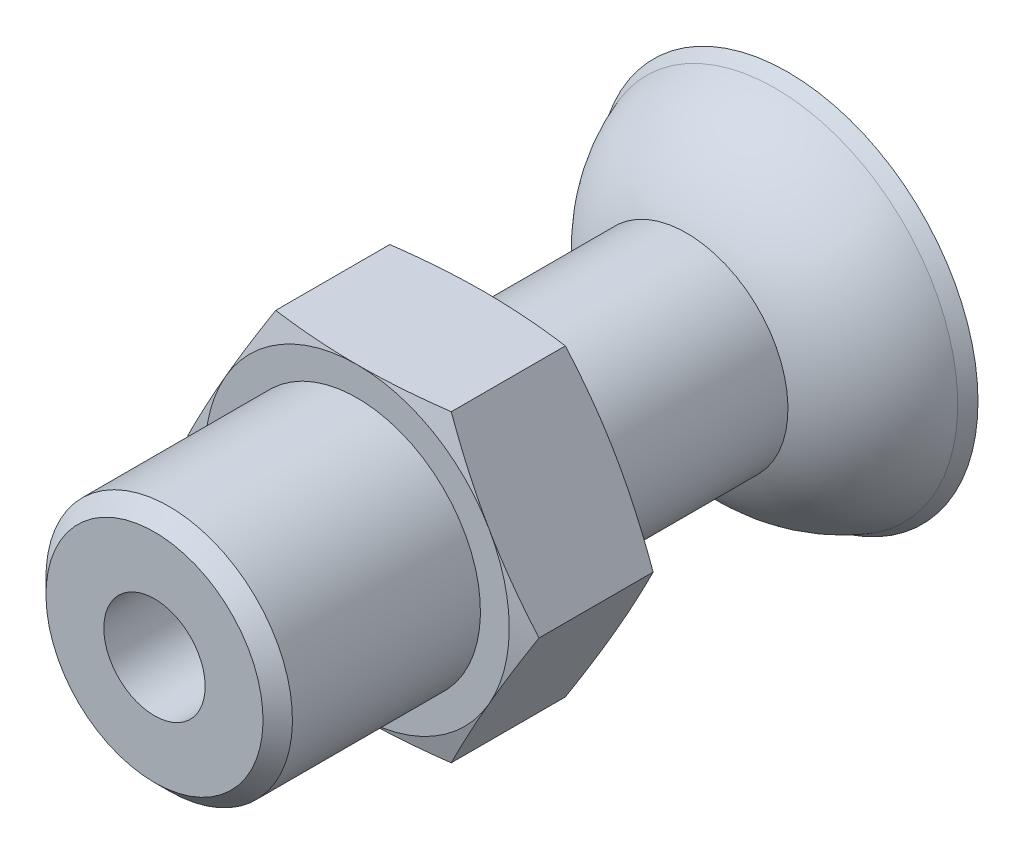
ISO-10303-21;
HEADER;
FILE_DESCRIPTION(('STEP AP214'),'2;1');
FILE_NAME('part.step','',(''),(''),'','','');
FILE_SCHEMA(('AUTOMOTIVE_DESIGN { 1 0 10303 214 1 1 1 1 }'));
ENDSEC;
DATA;
#1=APPLICATION_CONTEXT('core data for automotive mechanical design processes');
#2=APPLICATION_PROTOCOL_DEFINITION('international standard','automotive_design',2000,#1);
#3=PRODUCT_CONTEXT('',#1,'mechanical');
#4=PRODUCT('Part','Part','',(#3));
#5=PRODUCT_RELATED_PRODUCT_CATEGORY('part','',(#4));
#6=PRODUCT_DEFINITION_FORMATION('','',#4);
#7=PRODUCT_DEFINITION_CONTEXT('part definition',#1,'design');
#8=PRODUCT_DEFINITION('design','',#6,#7);
#9=PRODUCT_DEFINITION_SHAPE('','',#8);
#10=(LENGTH_UNIT() NAMED_UNIT(*) SI_UNIT(.MILLI.,.METRE.));
#11=(NAMED_UNIT(*) PLANE_ANGLE_UNIT() SI_UNIT($,.RADIAN.));
#12=(NAMED_UNIT(*) SI_UNIT($,.STERADIAN.) SOLID_ANGLE_UNIT());
#13=UNCERTAINTY_MEASURE_WITH_UNIT(LENGTH_MEASURE(1.E-05),#10,'distance_accuracy_value','');
#14=(GEOMETRIC_REPRESENTATION_CONTEXT(3) GLOBAL_UNCERTAINTY_ASSIGNED_CONTEXT((#13)) GLOBAL_UNIT_ASSIGNED_CONTEXT((#10,
#11,#12)) REPRESENTATION_CONTEXT('',''));
#15=CARTESIAN_POINT('',(0.,0.,0.));
#16=DIRECTION('',(0.,0.,1.));
#17=DIRECTION('',(1.,0.,0.));
#18=AXIS2_PLACEMENT_3D('',#15,#16,#17);
#19=CARTESIAN_POINT('',(6.92820323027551,0.,12.));
#20=DIRECTION('',(0.866025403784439,0.5,0.));
#21=DIRECTION('',(0.,0.,1.));
#22=AXIS2_PLACEMENT_3D('',#19,#20,#21);
#23=PLANE('',#22);
#24=DIRECTION('',(0.,0.,1.));
#25=VECTOR('',#24,1.);
#26=CARTESIAN_POINT('',(3.46410161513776,6.,12.));
#27=LINE('',#26,#25);
#28=CARTESIAN_POINT('',(3.46410161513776,6.,12.2487113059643));
#29=VERTEX_POINT('',#28);
#30=CARTESIAN_POINT('',(3.46410161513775,6.,16.7512886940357));
#31=VERTEX_POINT('',#30);
#32=EDGE_CURVE('E10',#29,#31,#27,.T.);
#33=ORIENTED_EDGE('',*,*,#32,.T.);
#34=CARTESIAN_POINT('',(5.19615242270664,3.00000000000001,17.));
#35=CARTESIAN_POINT('',(5.12404359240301,3.12480967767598,17.0000199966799));
#36=CARTESIAN_POINT('',(5.05188034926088,3.24958799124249,16.9986484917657));
#37=CARTESIAN_POINT('',(4.90798279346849,3.49847134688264,16.9931540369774));
#38=CARTESIAN_POINT('',(4.83624819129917,3.62257653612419,16.9890453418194));
#39=CARTESIAN_POINT('',(4.6926345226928,3.87142043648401,16.9780801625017));
#40=CARTESIAN_POINT('',(4.62075656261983,3.99615917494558,16.9712098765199));
#41=CARTESIAN_POINT('',(4.47601669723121,4.24735284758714,16.9547641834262));
#42=CARTESIAN_POINT('',(4.40315594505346,4.37380590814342,16.9451503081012));
#43=CARTESIAN_POINT('',(4.2592900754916,4.62306506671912,16.9237525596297));
#44=CARTESIAN_POINT('',(4.18828746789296,4.74587821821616,16.912033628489));
#45=CARTESIAN_POINT('',(4.04576334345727,4.99249350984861,16.8862377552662));
#46=CARTESIAN_POINT('',(3.97424314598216,5.11629421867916,16.8721398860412));
#47=CARTESIAN_POINT('',(3.83027325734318,5.36560571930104,16.8416075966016));
#48=CARTESIAN_POINT('',(3.75782595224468,5.49111391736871,16.8251409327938));
#49=CARTESIAN_POINT('',(3.61160134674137,5.74445673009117,16.7898805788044));
#50=CARTESIAN_POINT('',(3.53782665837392,5.87228726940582,16.7710466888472));
#51=CARTESIAN_POINT('',(3.46410161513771,5.99999999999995,16.7512886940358));
#52=B_SPLINE_CURVE_WITH_KNOTS('',3,(#34,#35,#36,#37,#38,#39,#40,#41,#42,#43,#44,#45,#46,#47,#48,
#49,#50,#51),.UNSPECIFIED.,.F.,.F.,(4,2,2,2,2,2,2,2,4),(0.,0.432421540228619,0.862608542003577,
1.29497279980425,1.73372521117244,2.16073850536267,2.59172526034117,3.02925966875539,
3.47560935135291),.UNSPECIFIED.);
#53=CARTESIAN_POINT('',(5.19615242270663,3.,17.));
#54=VERTEX_POINT('',#53);
#55=EDGE_CURVE('E767',#54,#31,#52,.T.);
#56=ORIENTED_EDGE('',*,*,#55,.F.);
#57=CARTESIAN_POINT('',(6.92820323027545,0.,16.7512886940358));
#58=CARTESIAN_POINT('',(6.85446990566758,0.127692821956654,16.7710449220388));
#59=CARTESIAN_POINT('',(6.78066033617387,0.255488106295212,16.7898769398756));
#60=CARTESIAN_POINT('',(6.63438238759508,0.508780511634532,16.8251348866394));
#61=CARTESIAN_POINT('',(6.56191621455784,0.634273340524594,16.841600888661));
#62=CARTESIAN_POINT('',(6.41799291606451,0.883612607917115,16.8721331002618));
#63=CARTESIAN_POINT('',(6.3465368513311,1.00745570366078,16.8862314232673));
#64=CARTESIAN_POINT('',(6.20421306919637,1.25420625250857,16.9120298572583));
#65=CARTESIAN_POINT('',(6.13334596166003,1.37711187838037,16.9237507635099));
#66=CARTESIAN_POINT('',(5.98940836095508,1.62632912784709,16.9451502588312));
#67=CARTESIAN_POINT('',(5.91633055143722,1.75264209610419,16.9547643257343));
#68=CARTESIAN_POINT('',(5.77116669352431,2.00357128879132,16.9712102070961));
#69=CARTESIAN_POINT('',(5.69908163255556,2.12818555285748,16.9780803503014));
#70=CARTESIAN_POINT('',(5.55538561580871,2.37698191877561,16.9890454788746));
#71=CARTESIAN_POINT('',(5.48377408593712,2.50116308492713,16.9931541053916));
#72=CARTESIAN_POINT('',(5.34017760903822,2.75023994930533,16.9986485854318));
#73=CARTESIAN_POINT('',(5.26819267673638,2.87513597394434,17.0000200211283));
#74=CARTESIAN_POINT('',(5.19615242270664,3.00000000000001,17.));
#75=B_SPLINE_CURVE_WITH_KNOTS('',3,(#57,#58,#59,#60,#61,#62,#63,#64,#65,#66,#67,#68,#69,#70,#71,
#72,#73,#74),.UNSPECIFIED.,.F.,.F.,(4,2,2,2,2,2,2,2,4),(0.,0.446310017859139,0.883832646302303,
1.31483340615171,1.74188406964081,2.18059822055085,2.61294971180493,3.04314949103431,
3.47560937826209),.UNSPECIFIED.);
#76=CARTESIAN_POINT('',(6.92820323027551,0.,16.7512886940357));
#77=VERTEX_POINT('',#76);
#78=EDGE_CURVE('E796',#77,#54,#75,.T.);
#79=ORIENTED_EDGE('',*,*,#78,.F.);
#80=DIRECTION('',(0.,0.,1.));
#81=VECTOR('',#80,1.);
#82=CARTESIAN_POINT('',(6.92820323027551,0.,12.));
#83=LINE('',#82,#81);
#84=CARTESIAN_POINT('',(6.92820323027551,0.,12.2487113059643));
#85=VERTEX_POINT('',#84);
#86=EDGE_CURVE('E466',#85,#77,#83,.T.);
#87=ORIENTED_EDGE('',*,*,#86,.F.);
#88=CARTESIAN_POINT('',(5.19615242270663,3.,12.));
#89=CARTESIAN_POINT('',(5.26818635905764,2.87514708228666,11.9999800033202));
#90=CARTESIAN_POINT('',(5.34016592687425,2.75026272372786,12.0013515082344));
#91=CARTESIAN_POINT('',(5.48375645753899,2.50120210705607,12.0068459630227));
#92=CARTESIAN_POINT('',(5.55536740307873,2.37702552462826,12.0109546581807));
#93=CARTESIAN_POINT('',(5.69906570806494,2.12823048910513,12.0219198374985));
#94=CARTESIAN_POINT('',(5.77115364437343,2.00361298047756,12.0287901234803));
#95=CARTESIAN_POINT('',(5.91632381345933,1.75266774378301,12.0452358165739));
#96=CARTESIAN_POINT('',(5.98940500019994,1.6263419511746,12.0548496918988));
#97=CARTESIAN_POINT('',(6.13333682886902,1.377120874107,12.0762474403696));
#98=CARTESIAN_POINT('',(6.20419483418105,1.25422423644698,12.0879663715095));
#99=CARTESIAN_POINT('',(6.34650787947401,1.00748707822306,12.1137622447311));
#100=CARTESIAN_POINT('',(6.41796233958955,0.883648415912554,12.1278601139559));
#101=CARTESIAN_POINT('',(6.56188748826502,0.634311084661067,12.1583924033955));
#102=CARTESIAN_POINT('',(6.63435712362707,0.50881577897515,12.1748590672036));
#103=CARTESIAN_POINT('',(6.78064613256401,0.25551014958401,12.210119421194));
#104=CARTESIAN_POINT('',(6.8544632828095,0.127704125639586,12.2289533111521));
#105=CARTESIAN_POINT('',(6.92820323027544,0.,12.2487113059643));
#106=B_SPLINE_CURVE_WITH_KNOTS('',3,(#88,#89,#90,#91,#92,#93,#94,#95,#96,#97,#98,#99,#100,#101,
#102,#103,#104,#105),.UNSPECIFIED.,.F.,.F.,(4,2,2,2,2,2,2,2,4),(0.,0.432421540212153,
0.862608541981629,1.29497279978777,1.73372521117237,2.16073850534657,2.59172526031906,
3.02925966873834,3.47560935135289),.UNSPECIFIED.);
#107=CARTESIAN_POINT('',(5.19615242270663,3.,12.));
#108=VERTEX_POINT('',#107);
#109=EDGE_CURVE('E689',#108,#85,#106,.T.);
#110=ORIENTED_EDGE('',*,*,#109,.F.);
#111=CARTESIAN_POINT('',(3.46410161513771,5.99999999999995,12.2487113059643));
#112=CARTESIAN_POINT('',(3.53782018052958,5.87229865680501,12.2289550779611));
#113=CARTESIAN_POINT('',(3.61158935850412,5.74448005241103,12.2101230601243));
#114=CARTESIAN_POINT('',(3.75780804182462,5.49115343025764,12.1748651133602));
#115=CARTESIAN_POINT('',(3.83025493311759,5.36564946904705,12.1583991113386));
#116=CARTESIAN_POINT('',(3.97422742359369,5.11633860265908,12.1278668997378));
#117=CARTESIAN_POINT('',(4.04575065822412,4.99253428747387,12.1137685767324));
#118=CARTESIAN_POINT('',(4.1882810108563,4.74590300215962,12.0879701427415));
#119=CARTESIAN_POINT('',(4.25928685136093,4.6230774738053,12.0762492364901));
#120=CARTESIAN_POINT('',(4.4031465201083,4.37381523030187,12.0548497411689));
#121=CARTESIAN_POINT('',(4.47599785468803,4.24737150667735,12.0452356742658));
#122=CARTESIAN_POINT('',(4.62072698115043,3.996191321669,12.028789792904));
#123=CARTESIAN_POINT('',(4.69260356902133,3.87145669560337,12.0219196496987));
#124=CARTESIAN_POINT('',(4.83621953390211,3.62261411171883,12.0109545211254));
#125=CARTESIAN_POINT('',(4.90795781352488,3.49850612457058,12.0068458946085));
#126=CARTESIAN_POINT('',(5.05186646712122,3.24960949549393,12.0013514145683));
#127=CARTESIAN_POINT('',(5.12403713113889,3.12482070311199,11.9999799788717));
#128=CARTESIAN_POINT('',(5.19615242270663,3.,12.));
#129=B_SPLINE_CURVE_WITH_KNOTS('',3,(#111,#112,#113,#114,#115,#116,#117,#118,#119,#120,#121,
#122,#123,#124,#125,#126,#127,#128),.UNSPECIFIED.,.F.,.F.,(4,2,2,2,2,2,2,2,4),(0.,
0.446310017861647,0.883832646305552,1.31483340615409,1.74188406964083,2.18059822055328,
2.61294971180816,3.04314949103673,3.47560937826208),.UNSPECIFIED.);
#130=EDGE_CURVE('E613',#29,#108,#129,.T.);
#131=ORIENTED_EDGE('',*,*,#130,.F.);
#132=EDGE_LOOP('',(#33,#56,#79,#87,#110,#131));
#133=FACE_BOUND('',#132,.T.);
#134=ADVANCED_FACE('F15',(#133),#23,.T.);
#135=CARTESIAN_POINT('',(3.46410161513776,6.,12.));
#136=DIRECTION('',(0.,1.,0.));
#137=DIRECTION('',(-1.,0.,0.));
#138=AXIS2_PLACEMENT_3D('',#135,#136,#137);
#139=PLANE('',#138);
#140=DIRECTION('',(0.,0.,1.));
#141=VECTOR('',#140,1.);
#142=CARTESIAN_POINT('',(-3.46410161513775,6.,12.));
#143=LINE('',#142,#141);
#144=CARTESIAN_POINT('',(-3.46410161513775,6.,12.2487113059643));
#145=VERTEX_POINT('',#144);
#146=CARTESIAN_POINT('',(-3.46410161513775,6.,16.7512886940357));
#147=VERTEX_POINT('',#146);
#148=EDGE_CURVE('E29',#145,#147,#143,.T.);
#149=ORIENTED_EDGE('',*,*,#148,.T.);
#150=CARTESIAN_POINT('',(0.,6.00000000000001,17.));
#151=CARTESIAN_POINT('',(-0.144124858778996,5.99995669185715,17.0000200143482));
#152=CARTESIAN_POINT('',(-0.288249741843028,5.99985529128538,16.998647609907));
#153=CARTESIAN_POINT('',(-0.575724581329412,5.99969177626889,16.9931504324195));
#154=CARTESIAN_POINT('',(-0.719074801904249,5.9996294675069,16.9890394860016));
#155=CARTESIAN_POINT('',(-1.00641973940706,5.99969625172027,16.9780688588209));
#156=CARTESIAN_POINT('',(-1.15041390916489,5.99982634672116,16.9711949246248));
#157=CARTESIAN_POINT('',(-1.44040510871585,6.00008659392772,16.9547411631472));
#158=CARTESIAN_POINT('',(-1.58639991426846,6.00021671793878,16.9451224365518));
#159=CARTESIAN_POINT('',(-1.87425873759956,6.00025188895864,16.9237187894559));
#160=CARTESIAN_POINT('',(-2.01612766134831,6.0001629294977,16.9119995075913));
#161=CARTESIAN_POINT('',(-2.30096544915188,6.00002759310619,16.8862047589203));
#162=CARTESIAN_POINT('',(-2.44393243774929,5.99998161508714,16.8721086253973));
#163=CARTESIAN_POINT('',(-2.73179478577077,5.9999399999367,16.8415817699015));
#164=CARTESIAN_POINT('',(-2.87668673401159,5.99994513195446,16.8251190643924));
#165=CARTESIAN_POINT('',(-3.1691318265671,5.99997062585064,16.7898686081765));
#166=CARTESIAN_POINT('',(-3.31668016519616,5.99999129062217,16.7710409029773));
#167=CARTESIAN_POINT('',(-3.46410161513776,6.00000000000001,16.7512886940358));
#168=B_SPLINE_CURVE_WITH_KNOTS('',3,(#150,#151,#152,#153,#154,#155,#156,#157,#158,#159,#160,
#161,#162,#163,#164,#165,#166,#167),.UNSPECIFIED.,.F.,.F.,(4,2,2,2,2,2,2,2,4),(0.,
0.432367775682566,0.862568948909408,1.29501848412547,1.73393012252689,2.16096837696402,
2.59193173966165,3.02939030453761,3.47560819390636),.UNSPECIFIED.);
#169=CARTESIAN_POINT('',(0.,6.,17.));
#170=VERTEX_POINT('',#169);
#171=EDGE_CURVE('E515',#170,#147,#168,.T.);
#172=ORIENTED_EDGE('',*,*,#171,.F.);
#173=CARTESIAN_POINT('',(3.46410161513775,6.00000000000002,16.7512886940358));
#174=CARTESIAN_POINT('',(3.31726869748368,5.99999159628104,16.7709619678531));
#175=CARTESIAN_POINT('',(3.17031004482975,5.99996749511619,16.7897190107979));
#176=CARTESIAN_POINT('',(2.8790373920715,5.99993021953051,16.8248474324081));
#177=CARTESIAN_POINT('',(2.73472816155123,5.9999168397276,16.8412584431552));
#178=CARTESIAN_POINT('',(2.44803367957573,5.99993958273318,16.8717010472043));
#179=CARTESIAN_POINT('',(2.30565182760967,5.99997497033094,16.8857644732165));
#180=CARTESIAN_POINT('',(2.02199764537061,6.00008886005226,16.9115131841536));
#181=CARTESIAN_POINT('',(1.88072720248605,6.00016696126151,16.923219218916));
#182=CARTESIAN_POINT('',(1.59291852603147,6.00012156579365,16.9447025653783));
#183=CARTESIAN_POINT('',(1.44637393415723,5.99999070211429,16.9543951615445));
#184=CARTESIAN_POINT('',(1.15526705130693,5.99974077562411,16.9709752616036));
#185=CARTESIAN_POINT('',(1.01070698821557,5.99962156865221,16.9779015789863));
#186=CARTESIAN_POINT('',(0.722199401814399,5.99958067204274,16.9889562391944));
#187=CARTESIAN_POINT('',(0.578252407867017,5.99965800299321,16.9930983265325));
#188=CARTESIAN_POINT('',(0.289537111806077,5.99984558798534,16.9986377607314));
#189=CARTESIAN_POINT('',(0.144768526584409,5.99995601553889,17.0000203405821));
#190=CARTESIAN_POINT('',(0.,6.00000000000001,17.));
#191=B_SPLINE_CURVE_WITH_KNOTS('',3,(#173,#174,#175,#176,#177,#178,#179,#180,#181,#182,#183,
#184,#185,#186,#187,#188,#189,#190),.UNSPECIFIED.,.F.,.F.,(4,2,2,2,2,2,2,2,4),(0.,
0.444436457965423,0.880140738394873,1.30934776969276,1.73459368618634,2.17516540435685,
2.6093178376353,3.04131099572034,3.47560975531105),.UNSPECIFIED.);
#192=EDGE_CURVE('E737',#31,#170,#191,.T.);
#193=ORIENTED_EDGE('',*,*,#192,.F.);
#194=ORIENTED_EDGE('',*,*,#32,.F.);
#195=CARTESIAN_POINT('',(0.,6.,12.));
#196=CARTESIAN_POINT('',(0.144124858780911,5.99995669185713,11.9999799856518));
#197=CARTESIAN_POINT('',(0.288249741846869,5.99985529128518,12.001352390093));
#198=CARTESIAN_POINT('',(0.575724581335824,5.99969177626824,12.0068495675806));
#199=CARTESIAN_POINT('',(0.719074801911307,5.99962946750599,12.0109605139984));
#200=CARTESIAN_POINT('',(1.00641973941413,5.99969625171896,12.0219311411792));
#201=CARTESIAN_POINT('',(1.15041390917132,5.99982634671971,12.0288050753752));
#202=CARTESIAN_POINT('',(1.4404051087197,6.00008659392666,12.0452588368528));
#203=CARTESIAN_POINT('',(1.58639991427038,6.00021671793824,12.0548775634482));
#204=CARTESIAN_POINT('',(1.87425873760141,6.00025188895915,12.0762812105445));
#205=CARTESIAN_POINT('',(2.01612766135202,6.00016292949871,12.0880004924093));
#206=CARTESIAN_POINT('',(2.30096544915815,6.0000275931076,12.1137952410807));
#207=CARTESIAN_POINT('',(2.44393243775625,5.99998161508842,12.1278913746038));
#208=CARTESIAN_POINT('',(2.73179478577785,5.9999399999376,12.1584182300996));
#209=CARTESIAN_POINT('',(2.87668673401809,5.99994513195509,12.1748809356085));
#210=CARTESIAN_POINT('',(3.16913182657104,5.99997062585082,12.210131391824));
#211=CARTESIAN_POINT('',(3.31668016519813,5.99999129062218,12.228959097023));
#212=CARTESIAN_POINT('',(3.46410161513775,6.00000000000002,12.2487113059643));
#213=B_SPLINE_CURVE_WITH_KNOTS('',3,(#195,#196,#197,#198,#199,#200,#201,#202,#203,#204,#205,
#206,#207,#208,#209,#210,#211,#212),.UNSPECIFIED.,.F.,.F.,(4,2,2,2,2,2,2,2,4),(0.,
0.432367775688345,0.862568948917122,1.29501848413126,1.73393012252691,2.16096837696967,
2.59193173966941,3.02939030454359,3.47560819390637),.UNSPECIFIED.);
#214=CARTESIAN_POINT('',(0.,6.,12.));
#215=VERTEX_POINT('',#214);
#216=EDGE_CURVE('E619',#215,#29,#213,.T.);
#217=ORIENTED_EDGE('',*,*,#216,.F.);
#218=CARTESIAN_POINT('',(-3.46410161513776,6.00000000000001,12.2487113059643));
#219=CARTESIAN_POINT('',(-3.31726869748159,5.99999159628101,12.2290380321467));
#220=CARTESIAN_POINT('',(-3.17031004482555,5.99996749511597,12.2102809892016));
#221=CARTESIAN_POINT('',(-2.87903739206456,5.99993021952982,12.1751525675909));
#222=CARTESIAN_POINT('',(-2.73472816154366,5.99991683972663,12.1587415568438));
#223=CARTESIAN_POINT('',(-2.44803367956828,5.9999395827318,12.1282989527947));
#224=CARTESIAN_POINT('',(-2.30565182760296,5.99997497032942,12.1142355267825));
#225=CARTESIAN_POINT('',(-2.02199764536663,6.00008886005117,12.0884868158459));
#226=CARTESIAN_POINT('',(-1.88072720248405,6.00016696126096,12.0767807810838));
#227=CARTESIAN_POINT('',(-1.5929185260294,6.00012156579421,12.0552974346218));
#228=CARTESIAN_POINT('',(-1.4463739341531,5.99999070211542,12.0456048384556));
#229=CARTESIAN_POINT('',(-1.15526705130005,5.99974077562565,12.0290247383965));
#230=CARTESIAN_POINT('',(-1.01070698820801,5.9996215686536,12.0220984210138));
#231=CARTESIAN_POINT('',(-0.722199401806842,5.99958067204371,12.0110437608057));
#232=CARTESIAN_POINT('',(-0.578252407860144,5.99965800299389,12.0069016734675));
#233=CARTESIAN_POINT('',(-0.289537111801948,5.99984558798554,12.0013622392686));
#234=CARTESIAN_POINT('',(-0.144768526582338,5.9999560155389,11.9999796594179));
#235=CARTESIAN_POINT('',(0.,6.,12.));
#236=B_SPLINE_CURVE_WITH_KNOTS('',3,(#218,#219,#220,#221,#222,#223,#224,#225,#226,#227,#228,
#229,#230,#231,#232,#233,#234,#235),.UNSPECIFIED.,.F.,.F.,(4,2,2,2,2,2,2,2,4),(0.,
0.44443645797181,0.880140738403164,1.3093477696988,1.73459368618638,2.17516540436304,
2.60931783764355,3.04131099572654,3.47560975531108),.UNSPECIFIED.);
#237=EDGE_CURVE('E171',#145,#215,#236,.T.);
#238=ORIENTED_EDGE('',*,*,#237,.F.);
#239=EDGE_LOOP('',(#149,#172,#193,#194,#217,#238));
#240=FACE_BOUND('',#239,.T.);
#241=ADVANCED_FACE('F223',(#240),#139,.T.);
#242=CARTESIAN_POINT('',(-3.46410161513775,6.,12.));
#243=DIRECTION('',(-0.866025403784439,0.5,0.));
#244=DIRECTION('',(0.,0.,-1.));
#245=AXIS2_PLACEMENT_3D('',#242,#243,#244);
#246=PLANE('',#245);
#247=DIRECTION('',(0.,0.,1.));
#248=VECTOR('',#247,1.);
#249=CARTESIAN_POINT('',(-6.92820323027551,0.,12.));
#250=LINE('',#249,#248);
#251=CARTESIAN_POINT('',(-6.92820323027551,0.,12.2487113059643));
#252=VERTEX_POINT('',#251);
#253=CARTESIAN_POINT('',(-6.92820323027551,0.,16.7512886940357));
#254=VERTEX_POINT('',#253);
#255=EDGE_CURVE('E584',#252,#254,#250,.T.);
#256=ORIENTED_EDGE('',*,*,#255,.T.);
#257=CARTESIAN_POINT('',(-5.19615242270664,3.,17.));
#258=CARTESIAN_POINT('',(-5.26818635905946,2.87514708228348,17.0000199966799));
#259=CARTESIAN_POINT('',(-5.3401659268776,2.75026272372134,16.9986484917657));
#260=CARTESIAN_POINT('',(-5.48375645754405,2.5012021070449,16.9931540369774));
#261=CARTESIAN_POINT('',(-5.55536740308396,2.37702552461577,16.9890453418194));
#262=CARTESIAN_POINT('',(-5.69906570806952,2.12823048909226,16.9780801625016));
#263=CARTESIAN_POINT('',(-5.77115364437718,2.00361298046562,16.9712098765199));
#264=CARTESIAN_POINT('',(-5.91632381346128,1.75266774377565,16.9547641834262));
#265=CARTESIAN_POINT('',(-5.98940500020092,1.62634195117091,16.9451503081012));
#266=CARTESIAN_POINT('',(-6.13333682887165,1.37712087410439,16.9237525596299));
#267=CARTESIAN_POINT('',(-6.20419483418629,1.25422423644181,16.9120336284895));
#268=CARTESIAN_POINT('',(-6.34650787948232,1.00748707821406,16.8862377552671));
#269=CARTESIAN_POINT('',(-6.41796233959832,0.883648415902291,16.8721398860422));
#270=CARTESIAN_POINT('',(-6.56188748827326,0.634311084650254,16.8416075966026));
#271=CARTESIAN_POINT('',(-6.63435712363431,0.508815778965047,16.8251409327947));
#272=CARTESIAN_POINT('',(-6.78064613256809,0.255510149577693,16.789880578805));
#273=CARTESIAN_POINT('',(-6.85446328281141,0.127704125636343,16.7710466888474));
#274=CARTESIAN_POINT('',(-6.92820323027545,0.,16.7512886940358));
#275=B_SPLINE_CURVE_WITH_KNOTS('',3,(#257,#258,#259,#260,#261,#262,#263,#264,#265,#266,#267,
#268,#269,#270,#271,#272,#273,#274),.UNSPECIFIED.,.F.,.F.,(4,2,2,2,2,2,2,2,4),(0.,
0.432421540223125,0.86260854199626,1.29497279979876,1.73372521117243,2.16073850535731,
2.5917252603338,3.02925966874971,3.47560935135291),.UNSPECIFIED.);
#276=CARTESIAN_POINT('',(-5.19615242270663,3.,17.));
#277=VERTEX_POINT('',#276);
#278=EDGE_CURVE('E544',#277,#254,#275,.T.);
#279=ORIENTED_EDGE('',*,*,#278,.F.);
#280=CARTESIAN_POINT('',(-3.46410161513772,5.99999999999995,16.7512886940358));
#281=CARTESIAN_POINT('',(-3.53782018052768,5.87229865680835,16.7710449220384));
#282=CARTESIAN_POINT('',(-3.6115893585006,5.74448005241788,16.7898769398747));
#283=CARTESIAN_POINT('',(-3.75780804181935,5.49115343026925,16.825134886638));
#284=CARTESIAN_POINT('',(-3.8302549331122,5.36564946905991,16.8416008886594));
#285=CARTESIAN_POINT('',(-3.97422742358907,5.11633860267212,16.8721331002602));
#286=CARTESIAN_POINT('',(-4.04575065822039,4.99253428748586,16.8862314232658));
#287=CARTESIAN_POINT('',(-4.18828101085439,4.74590300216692,16.9120298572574));
#288=CARTESIAN_POINT('',(-4.25928685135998,4.62307747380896,16.9237507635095));
#289=CARTESIAN_POINT('',(-4.40314652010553,4.37381523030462,16.9451502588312));
#290=CARTESIAN_POINT('',(-4.4759978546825,4.24737150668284,16.9547643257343));
#291=CARTESIAN_POINT('',(-4.62072698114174,3.99619132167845,16.9712102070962));
#292=CARTESIAN_POINT('',(-4.69260356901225,3.87145669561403,16.9780803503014));
#293=CARTESIAN_POINT('',(-4.8362195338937,3.62261411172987,16.9890454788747));
#294=CARTESIAN_POINT('',(-4.90795781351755,3.49850612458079,16.9931541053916));
#295=CARTESIAN_POINT('',(-5.05186646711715,3.24960949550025,16.9986485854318));
#296=CARTESIAN_POINT('',(-5.12403713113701,3.12482070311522,17.0000200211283));
#297=CARTESIAN_POINT('',(-5.19615242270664,3.,17.));
#298=B_SPLINE_CURVE_WITH_KNOTS('',3,(#280,#281,#282,#283,#284,#285,#286,#287,#288,#289,#290,
#291,#292,#293,#294,#295,#296,#297),.UNSPECIFIED.,.F.,.F.,(4,2,2,2,2,2,2,2,4),(0.,
0.446310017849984,0.883832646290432,1.31483340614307,1.74188406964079,2.18059822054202,
2.61294971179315,3.04314949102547,3.47560937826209),.UNSPECIFIED.);
#299=EDGE_CURVE('E542',#147,#277,#298,.T.);
#300=ORIENTED_EDGE('',*,*,#299,.F.);
#301=ORIENTED_EDGE('',*,*,#148,.F.);
#302=CARTESIAN_POINT('',(-5.19615242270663,3.,12.));
#303=CARTESIAN_POINT('',(-5.12404359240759,3.12480967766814,11.9999800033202));
#304=CARTESIAN_POINT('',(-5.05188034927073,3.24958799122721,12.0013515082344));
#305=CARTESIAN_POINT('',(-4.90798279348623,3.49847134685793,12.0068459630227));
#306=CARTESIAN_POINT('',(-4.83624819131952,3.62257653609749,12.0109546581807));
#307=CARTESIAN_POINT('',(-4.69263452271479,3.87142043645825,12.0219198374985));
#308=CARTESIAN_POINT('',(-4.62075656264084,3.99615917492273,12.0287901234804));
#309=CARTESIAN_POINT('',(-4.47601669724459,4.24735284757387,12.045235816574));
#310=CARTESIAN_POINT('',(-4.40315594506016,4.37380590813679,12.0548496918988));
#311=CARTESIAN_POINT('',(-4.25929007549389,4.62306506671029,12.0762474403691));
#312=CARTESIAN_POINT('',(-4.18828746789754,4.74587821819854,12.0879663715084));
#313=CARTESIAN_POINT('',(-4.04576334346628,4.99249350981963,12.1137622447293));
#314=CARTESIAN_POINT('',(-3.97424314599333,5.11629421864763,12.127860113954));
#315=CARTESIAN_POINT('',(-3.83027325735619,5.36560571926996,12.1583924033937));
#316=CARTESIAN_POINT('',(-3.7578259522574,5.49111391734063,12.1748590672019));
#317=CARTESIAN_POINT('',(-3.61160134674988,5.74445673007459,12.210119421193));
#318=CARTESIAN_POINT('',(-3.53782665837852,5.87228726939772,12.2289533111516));
#319=CARTESIAN_POINT('',(-3.46410161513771,5.99999999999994,12.2487113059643));
#320=B_SPLINE_CURVE_WITH_KNOTS('',3,(#302,#303,#304,#305,#306,#307,#308,#309,#310,#311,#312,
#313,#314,#315,#316,#317,#318,#319),.UNSPECIFIED.,.F.,.F.,(4,2,2,2,2,2,2,2,4),(0.,
0.432421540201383,0.862608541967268,1.294972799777,1.73372521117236,2.16073850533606,
2.59172526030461,3.0292596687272,3.47560935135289),.UNSPECIFIED.);
#321=CARTESIAN_POINT('',(-5.19615242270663,3.,12.));
#322=VERTEX_POINT('',#321);
#323=EDGE_CURVE('E157',#322,#145,#320,.T.);
#324=ORIENTED_EDGE('',*,*,#323,.F.);
#325=CARTESIAN_POINT('',(-6.92820323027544,0.,12.2487113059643));
#326=CARTESIAN_POINT('',(-6.85446990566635,0.127692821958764,12.2289550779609));
#327=CARTESIAN_POINT('',(-6.78066033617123,0.255488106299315,12.2101230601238));
#328=CARTESIAN_POINT('',(-6.63438238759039,0.508780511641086,12.1748651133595));
#329=CARTESIAN_POINT('',(-6.5619162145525,0.634273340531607,12.1583991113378));
#330=CARTESIAN_POINT('',(-6.41799291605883,0.883612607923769,12.127866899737));
#331=CARTESIAN_POINT('',(-6.34653685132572,1.00745570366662,12.1137685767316));
#332=CARTESIAN_POINT('',(-6.20421306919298,1.25420625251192,12.0879701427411));
#333=CARTESIAN_POINT('',(-6.13334596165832,1.37711187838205,12.0762492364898));
#334=CARTESIAN_POINT('',(-5.98940836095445,1.62632912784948,12.0548497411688));
#335=CARTESIAN_POINT('',(-5.91633055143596,1.75264209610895,12.0452356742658));
#336=CARTESIAN_POINT('',(-5.77116669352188,2.00357128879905,12.028789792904));
#337=CARTESIAN_POINT('',(-5.69908163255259,2.12818555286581,12.0219196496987));
#338=CARTESIAN_POINT('',(-5.55538561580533,2.37698191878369,12.0109545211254));
#339=CARTESIAN_POINT('',(-5.48377408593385,2.50116308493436,12.0068458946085));
#340=CARTESIAN_POINT('',(-5.34017760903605,2.75023994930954,12.0013514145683));
#341=CARTESIAN_POINT('',(-5.2681926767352,2.87513597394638,11.9999799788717));
#342=CARTESIAN_POINT('',(-5.19615242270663,3.,12.));
#343=B_SPLINE_CURVE_WITH_KNOTS('',3,(#325,#326,#327,#328,#329,#330,#331,#332,#333,#334,#335,
#336,#337,#338,#339,#340,#341,#342),.UNSPECIFIED.,.F.,.F.,(4,2,2,2,2,2,2,2,4),(0.,
0.446310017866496,0.883832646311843,1.31483340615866,1.74188406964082,2.18059822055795,
2.6129497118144,3.0431494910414,3.47560937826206),.UNSPECIFIED.);
#344=EDGE_CURVE('E162',#252,#322,#343,.T.);
#345=ORIENTED_EDGE('',*,*,#344,.F.);
#346=EDGE_LOOP('',(#256,#279,#300,#301,#324,#345));
#347=FACE_BOUND('',#346,.T.);
#348=ADVANCED_FACE('F160',(#347),#246,.T.);
#349=CARTESIAN_POINT('',(-6.92820323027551,0.,12.));
#350=DIRECTION('',(-0.866025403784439,-0.5,0.));
#351=DIRECTION('',(0.,0.,-1.));
#352=AXIS2_PLACEMENT_3D('',#349,#350,#351);
#353=PLANE('',#352);
#354=DIRECTION('',(0.,0.,1.));
#355=VECTOR('',#354,1.);
#356=CARTESIAN_POINT('',(-3.46410161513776,-6.,12.));
#357=LINE('',#356,#355);
#358=CARTESIAN_POINT('',(-3.46410161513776,-6.,12.2487113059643));
#359=VERTEX_POINT('',#358);
#360=CARTESIAN_POINT('',(-3.46410161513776,-6.,16.7512886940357));
#361=VERTEX_POINT('',#360);
#362=EDGE_CURVE('E465',#359,#361,#357,.T.);
#363=ORIENTED_EDGE('',*,*,#362,.T.);
#364=CARTESIAN_POINT('',(-5.19615242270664,-3.,17.));
#365=CARTESIAN_POINT('',(-5.12404359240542,-3.12480967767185,17.0000199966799));
#366=CARTESIAN_POINT('',(-5.05188034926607,-3.24958799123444,16.9986484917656));
#367=CARTESIAN_POINT('',(-4.90798279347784,-3.49847134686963,16.9931540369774));
#368=CARTESIAN_POINT('',(-4.83624819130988,-3.62257653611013,16.9890453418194));
#369=CARTESIAN_POINT('',(-4.69263452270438,-3.87142043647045,16.9780801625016));
#370=CARTESIAN_POINT('',(-4.6207565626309,-3.99615917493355,16.9712098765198));
#371=CARTESIAN_POINT('',(-4.47601669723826,-4.24735284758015,16.9547641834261));
#372=CARTESIAN_POINT('',(-4.403155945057,-4.37380590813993,16.9451503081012));
#373=CARTESIAN_POINT('',(-4.25929007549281,-4.62306506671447,16.9237525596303));
#374=CARTESIAN_POINT('',(-4.18828746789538,-4.74587821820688,16.9120336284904));
#375=CARTESIAN_POINT('',(-4.04576334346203,-4.99249350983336,16.8862377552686));
#376=CARTESIAN_POINT('',(-3.97424314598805,-5.11629421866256,16.8721398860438));
#377=CARTESIAN_POINT('',(-3.83027325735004,-5.36560571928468,16.8416075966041));
#378=CARTESIAN_POINT('',(-3.75782595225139,-5.49111391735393,16.8251409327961));
#379=CARTESIAN_POINT('',(-3.61160134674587,-5.74445673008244,16.7898805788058));
#380=CARTESIAN_POINT('',(-3.53782665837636,-5.87228726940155,16.7710466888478));
#381=CARTESIAN_POINT('',(-3.46410161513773,-5.99999999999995,16.7512886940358));
#382=B_SPLINE_CURVE_WITH_KNOTS('',3,(#364,#365,#366,#367,#368,#369,#370,#371,#372,#373,#374,
#375,#376,#377,#378,#379,#380,#381),.UNSPECIFIED.,.F.,.F.,(4,2,2,2,2,2,2,2,4),(0.,
0.432421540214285,0.862608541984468,1.2949727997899,1.7337252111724,2.16073850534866,
2.59172526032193,3.02925966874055,3.47560935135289),.UNSPECIFIED.);
#383=CARTESIAN_POINT('',(-5.19615242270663,-3.,17.));
#384=VERTEX_POINT('',#383);
#385=EDGE_CURVE('E296',#384,#361,#382,.T.);
#386=ORIENTED_EDGE('',*,*,#385,.F.);
#387=CARTESIAN_POINT('',(-6.92820323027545,0.,16.7512886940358));
#388=CARTESIAN_POINT('',(-6.85446990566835,-0.12769282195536,16.7710449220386));
#389=CARTESIAN_POINT('',(-6.78066033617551,-0.25548810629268,16.7898769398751));
#390=CARTESIAN_POINT('',(-6.634382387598,-0.508780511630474,16.8251348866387));
#391=CARTESIAN_POINT('',(-6.56191621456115,-0.634273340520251,16.8416008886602));
#392=CARTESIAN_POINT('',(-6.41799291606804,-0.883612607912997,16.872133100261));
#393=CARTESIAN_POINT('',(-6.34653685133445,-1.00745570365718,16.8862314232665));
#394=CARTESIAN_POINT('',(-6.20421306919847,-1.25420625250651,16.9120298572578));
#395=CARTESIAN_POINT('',(-6.13334596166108,-1.37711187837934,16.9237507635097));
#396=CARTESIAN_POINT('',(-5.98940836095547,-1.62632912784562,16.9451502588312));
#397=CARTESIAN_POINT('',(-5.916330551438,-1.75264209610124,16.9547643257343));
#398=CARTESIAN_POINT('',(-5.77116669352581,-2.00357128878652,16.9712102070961));
#399=CARTESIAN_POINT('',(-5.69908163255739,-2.1281855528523,16.9780803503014));
#400=CARTESIAN_POINT('',(-5.55538561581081,-2.37698191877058,16.9890454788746));
#401=CARTESIAN_POINT('',(-5.48377408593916,-2.50116308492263,16.9931541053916));
#402=CARTESIAN_POINT('',(-5.34017760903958,-2.7502399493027,16.9986485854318));
#403=CARTESIAN_POINT('',(-5.26819267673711,-2.87513597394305,17.0000200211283));
#404=CARTESIAN_POINT('',(-5.19615242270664,-3.,17.));
#405=B_SPLINE_CURVE_WITH_KNOTS('',3,(#387,#388,#389,#390,#391,#392,#393,#394,#395,#396,#397,
#398,#399,#400,#401,#402,#403,#404),.UNSPECIFIED.,.F.,.F.,(4,2,2,2,2,2,2,2,4),(0.,
0.446310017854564,0.88383264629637,1.3148334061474,1.7418840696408,2.18059822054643,
2.61294971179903,3.04314949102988,3.47560937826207),.UNSPECIFIED.);
#406=EDGE_CURVE('E558',#254,#384,#405,.T.);
#407=ORIENTED_EDGE('',*,*,#406,.F.);
#408=ORIENTED_EDGE('',*,*,#255,.F.);
#409=CARTESIAN_POINT('',(-5.19615242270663,-3.,12.));
#410=CARTESIAN_POINT('',(-5.268186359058,-2.87514708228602,11.9999800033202));
#411=CARTESIAN_POINT('',(-5.34016592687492,-2.75026272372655,12.0013515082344));
#412=CARTESIAN_POINT('',(-5.48375645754,-2.50120210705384,12.0068459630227));
#413=CARTESIAN_POINT('',(-5.55536740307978,-2.37702552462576,12.0109546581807));
#414=CARTESIAN_POINT('',(-5.69906570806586,-2.12823048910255,12.0219198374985));
#415=CARTESIAN_POINT('',(-5.77115364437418,-2.00361298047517,12.0287901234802));
#416=CARTESIAN_POINT('',(-5.91632381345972,-1.75266774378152,12.0452358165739));
#417=CARTESIAN_POINT('',(-5.98940500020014,-1.62634195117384,12.0548496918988));
#418=CARTESIAN_POINT('',(-6.13333682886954,-1.37712087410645,12.0762474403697));
#419=CARTESIAN_POINT('',(-6.2041948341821,-1.25422423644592,12.0879663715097));
#420=CARTESIAN_POINT('',(-6.34650787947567,-1.00748707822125,12.1137622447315));
#421=CARTESIAN_POINT('',(-6.4179623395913,-0.883648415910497,12.1278601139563));
#422=CARTESIAN_POINT('',(-6.56188748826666,-0.634311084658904,12.1583924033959));
#423=CARTESIAN_POINT('',(-6.63435712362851,-0.508815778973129,12.174859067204));
#424=CARTESIAN_POINT('',(-6.78064613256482,-0.255510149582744,12.2101194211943));
#425=CARTESIAN_POINT('',(-6.85446328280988,-0.127704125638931,12.2289533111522));
#426=CARTESIAN_POINT('',(-6.92820323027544,0.,12.2487113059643));
#427=B_SPLINE_CURVE_WITH_KNOTS('',3,(#409,#410,#411,#412,#413,#414,#415,#416,#417,#418,#419,
#420,#421,#422,#423,#424,#425,#426),.UNSPECIFIED.,.F.,.F.,(4,2,2,2,2,2,2,2,4),(0.,
0.43242154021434,0.862608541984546,1.29497279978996,1.7337252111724,2.16073850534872,
2.591725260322,3.0292596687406,3.4756093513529),.UNSPECIFIED.);
#428=CARTESIAN_POINT('',(-5.19615242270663,-3.,12.));
#429=VERTEX_POINT('',#428);
#430=EDGE_CURVE('E189',#429,#252,#427,.T.);
#431=ORIENTED_EDGE('',*,*,#430,.F.);
#432=CARTESIAN_POINT('',(-3.46410161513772,-5.99999999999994,12.2487113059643));
#433=CARTESIAN_POINT('',(-3.53782018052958,-5.872298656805,12.2289550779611));
#434=CARTESIAN_POINT('',(-3.61158935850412,-5.74448005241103,12.2101230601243));
#435=CARTESIAN_POINT('',(-3.75780804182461,-5.49115343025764,12.1748651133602));
#436=CARTESIAN_POINT('',(-3.83025493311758,-5.36564946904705,12.1583991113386));
#437=CARTESIAN_POINT('',(-3.97422742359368,-5.11633860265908,12.1278668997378));
#438=CARTESIAN_POINT('',(-4.04575065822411,-4.99253428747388,12.1137685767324));
#439=CARTESIAN_POINT('',(-4.18828101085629,-4.74590300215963,12.0879701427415));
#440=CARTESIAN_POINT('',(-4.25928685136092,-4.62307747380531,12.0762492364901));
#441=CARTESIAN_POINT('',(-4.40314652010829,-4.37381523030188,12.0548497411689));
#442=CARTESIAN_POINT('',(-4.47599785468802,-4.24737150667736,12.0452356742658));
#443=CARTESIAN_POINT('',(-4.62072698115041,-3.99619132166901,12.0287897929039));
#444=CARTESIAN_POINT('',(-4.69260356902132,-3.87145669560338,12.0219196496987));
#445=CARTESIAN_POINT('',(-4.8362195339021,-3.62261411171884,12.0109545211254));
#446=CARTESIAN_POINT('',(-4.90795781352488,-3.49850612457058,12.0068458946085));
#447=CARTESIAN_POINT('',(-5.05186646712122,-3.24960949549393,12.0013514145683));
#448=CARTESIAN_POINT('',(-5.1240371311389,-3.12482070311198,11.9999799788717));
#449=CARTESIAN_POINT('',(-5.19615242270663,-3.,12.));
#450=B_SPLINE_CURVE_WITH_KNOTS('',3,(#432,#433,#434,#435,#436,#437,#438,#439,#440,#441,#442,
#443,#444,#445,#446,#447,#448,#449),.UNSPECIFIED.,.F.,.F.,(4,2,2,2,2,2,2,2,4),(0.,
0.446310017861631,0.883832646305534,1.31483340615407,1.74188406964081,2.18059822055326,
2.61294971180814,3.04314949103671,3.47560937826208),.UNSPECIFIED.);
#451=EDGE_CURVE('E200',#359,#429,#450,.T.);
#452=ORIENTED_EDGE('',*,*,#451,.F.);
#453=EDGE_LOOP('',(#363,#386,#407,#408,#431,#452));
#454=FACE_BOUND('',#453,.T.);
#455=ADVANCED_FACE('F222',(#454),#353,.T.);
#456=CARTESIAN_POINT('',(-3.46410161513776,-6.,12.));
#457=DIRECTION('',(0.,-1.,0.));
#458=DIRECTION('',(0.,0.,-1.));
#459=AXIS2_PLACEMENT_3D('',#456,#457,#458);
#460=PLANE('',#459);
#461=DIRECTION('',(0.,0.,1.));
#462=VECTOR('',#461,1.);
#463=CARTESIAN_POINT('',(3.46410161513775,-6.,12.));
#464=LINE('',#463,#462);
#465=CARTESIAN_POINT('',(3.46410161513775,-6.,12.2487113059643));
#466=VERTEX_POINT('',#465);
#467=CARTESIAN_POINT('',(3.46410161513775,-6.,16.7512886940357));
#468=VERTEX_POINT('',#467);
#469=EDGE_CURVE('E457',#466,#468,#464,.T.);
#470=ORIENTED_EDGE('',*,*,#469,.T.);
#471=CARTESIAN_POINT('',(0.,-6.00000000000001,17.));
#472=CARTESIAN_POINT('',(0.14412485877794,-5.99995669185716,17.0000200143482));
#473=CARTESIAN_POINT('',(0.288249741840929,-5.99985529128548,16.998647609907));
#474=CARTESIAN_POINT('',(0.575724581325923,-5.99969177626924,16.9931504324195));
#475=CARTESIAN_POINT('',(0.719074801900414,-5.9996294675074,16.9890394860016));
#476=CARTESIAN_POINT('',(1.00641973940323,-5.99969625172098,16.9780688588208));
#477=CARTESIAN_POINT('',(1.15041390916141,-5.99982634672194,16.9711949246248));
#478=CARTESIAN_POINT('',(1.44040510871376,-6.00008659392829,16.9547411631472));
#479=CARTESIAN_POINT('',(1.58639991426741,-6.00021671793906,16.9451224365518));
#480=CARTESIAN_POINT('',(1.87425873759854,-6.00025188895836,16.923718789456));
#481=CARTESIAN_POINT('',(2.01612766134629,-6.00016292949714,16.9119995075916));
#482=CARTESIAN_POINT('',(2.30096544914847,-6.00002759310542,16.8862047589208));
#483=CARTESIAN_POINT('',(2.4439324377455,-5.99998161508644,16.8721086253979));
#484=CARTESIAN_POINT('',(2.73179478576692,-5.99993999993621,16.841581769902));
#485=CARTESIAN_POINT('',(2.87668673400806,-5.99994513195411,16.8251190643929));
#486=CARTESIAN_POINT('',(3.16913182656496,-5.99997062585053,16.7898686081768));
#487=CARTESIAN_POINT('',(3.31668016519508,-5.99999129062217,16.7710409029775));
#488=CARTESIAN_POINT('',(3.46410161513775,-6.00000000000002,16.7512886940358));
#489=B_SPLINE_CURVE_WITH_KNOTS('',3,(#471,#472,#473,#474,#475,#476,#477,#478,#479,#480,#481,
#482,#483,#484,#485,#486,#487,#488),.UNSPECIFIED.,.F.,.F.,(4,2,2,2,2,2,2,2,4),(0.,
0.432367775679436,0.862568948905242,1.29501848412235,1.73393012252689,2.16096837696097,
2.59193173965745,3.02939030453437,3.47560819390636),.UNSPECIFIED.);
#490=CARTESIAN_POINT('',(0.,-6.,17.));
#491=VERTEX_POINT('',#490);
#492=EDGE_CURVE('E474',#491,#468,#489,.T.);
#493=ORIENTED_EDGE('',*,*,#492,.F.);
#494=CARTESIAN_POINT('',(-3.46410161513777,-6.00000000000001,16.7512886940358));
#495=CARTESIAN_POINT('',(-3.31726869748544,-5.99999159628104,16.7709619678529));
#496=CARTESIAN_POINT('',(-3.17031004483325,-5.99996749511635,16.7897190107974));
#497=CARTESIAN_POINT('',(-2.87903739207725,-5.99993021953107,16.8248474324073));
#498=CARTESIAN_POINT('',(-2.73472816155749,-5.99991683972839,16.8412584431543));
#499=CARTESIAN_POINT('',(-2.44803367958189,-5.99993958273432,16.8717010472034));
#500=CARTESIAN_POINT('',(-2.30565182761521,-5.99997497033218,16.8857644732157));
#501=CARTESIAN_POINT('',(-2.02199764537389,-6.00008886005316,16.9115131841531));
#502=CARTESIAN_POINT('',(-1.88072720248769,-6.00016696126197,16.9232192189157));
#503=CARTESIAN_POINT('',(-1.59291852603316,-6.00012156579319,16.9447025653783));
#504=CARTESIAN_POINT('',(-1.44637393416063,-5.99999070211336,16.9543951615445));
#505=CARTESIAN_POINT('',(-1.15526705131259,-5.99974077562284,16.9709752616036));
#506=CARTESIAN_POINT('',(-1.01070698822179,-5.99962156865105,16.9779015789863));
#507=CARTESIAN_POINT('',(-0.722199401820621,-5.99958067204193,16.9889562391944));
#508=CARTESIAN_POINT('',(-0.57825240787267,-5.99965800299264,16.9930983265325));
#509=CARTESIAN_POINT('',(-0.289537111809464,-5.99984558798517,16.9986377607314));
#510=CARTESIAN_POINT('',(-0.144768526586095,-5.99995601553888,17.0000203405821));
#511=CARTESIAN_POINT('',(0.,-6.00000000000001,17.));
#512=B_SPLINE_CURVE_WITH_KNOTS('',3,(#494,#495,#496,#497,#498,#499,#500,#501,#502,#503,#504,
#505,#506,#507,#508,#509,#510,#511),.UNSPECIFIED.,.F.,.F.,(4,2,2,2,2,2,2,2,4),(0.,
0.444436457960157,0.880140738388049,1.3093477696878,1.73459368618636,2.17516540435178,
2.60931783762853,3.04131099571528,3.47560975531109),.UNSPECIFIED.);
#513=EDGE_CURVE('E257',#361,#491,#512,.T.);
#514=ORIENTED_EDGE('',*,*,#513,.F.);
#515=ORIENTED_EDGE('',*,*,#362,.F.);
#516=CARTESIAN_POINT('',(0.,-6.,12.));
#517=CARTESIAN_POINT('',(-0.144124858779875,-5.99995669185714,11.9999799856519));
#518=CARTESIAN_POINT('',(-0.288249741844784,-5.99985529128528,12.001352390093));
#519=CARTESIAN_POINT('',(-0.575724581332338,-5.99969177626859,12.0068495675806));
#520=CARTESIAN_POINT('',(-0.719074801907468,-5.99962946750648,12.0109605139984));
#521=CARTESIAN_POINT('',(-1.00641973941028,-5.99969625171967,12.0219311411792));
#522=CARTESIAN_POINT('',(-1.15041390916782,-5.9998263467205,12.0288050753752));
#523=CARTESIAN_POINT('',(-1.44040510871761,-6.00008659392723,12.0452588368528));
#524=CARTESIAN_POINT('',(-1.58639991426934,-6.00021671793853,12.0548775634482));
#525=CARTESIAN_POINT('',(-1.8742587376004,-6.00025188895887,12.0762812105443));
#526=CARTESIAN_POINT('',(-2.01612766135,-6.00016292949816,12.088000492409));
#527=CARTESIAN_POINT('',(-2.30096544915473,-6.00002759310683,12.1137952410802));
#528=CARTESIAN_POINT('',(-2.44393243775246,-5.99998161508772,12.1278913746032));
#529=CARTESIAN_POINT('',(-2.731794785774,-5.99993999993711,12.158418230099));
#530=CARTESIAN_POINT('',(-2.87668673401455,-5.99994513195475,12.174880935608));
#531=CARTESIAN_POINT('',(-3.1691318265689,-5.99997062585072,12.2101313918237));
#532=CARTESIAN_POINT('',(-3.31668016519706,-5.99999129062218,12.2289590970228));
#533=CARTESIAN_POINT('',(-3.46410161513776,-6.00000000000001,12.2487113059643));
#534=B_SPLINE_CURVE_WITH_KNOTS('',3,(#516,#517,#518,#519,#520,#521,#522,#523,#524,#525,#526,
#527,#528,#529,#530,#531,#532,#533),.UNSPECIFIED.,.F.,.F.,(4,2,2,2,2,2,2,2,4),(0.,
0.432367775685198,0.862568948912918,1.2950184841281,1.7339301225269,2.16096837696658,
2.59193173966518,3.02939030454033,3.47560819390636),.UNSPECIFIED.);
#535=CARTESIAN_POINT('',(0.,-6.,12.));
#536=VERTEX_POINT('',#535);
#537=EDGE_CURVE('E208',#536,#359,#534,.T.);
#538=ORIENTED_EDGE('',*,*,#537,.F.);
#539=CARTESIAN_POINT('',(3.46410161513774,-6.00000000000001,12.2487113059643));
#540=CARTESIAN_POINT('',(3.31726869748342,-5.99999159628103,12.2290380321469));
#541=CARTESIAN_POINT('',(3.17031004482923,-5.99996749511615,12.2102809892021));
#542=CARTESIAN_POINT('',(2.87903739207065,-5.99993021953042,12.1751525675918));
#543=CARTESIAN_POINT('',(2.73472816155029,-5.99991683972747,12.1587415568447));
#544=CARTESIAN_POINT('',(2.44803367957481,-5.999939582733,12.1282989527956));
#545=CARTESIAN_POINT('',(2.30565182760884,-5.99997497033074,12.1142355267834));
#546=CARTESIAN_POINT('',(2.02199764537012,-6.00008886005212,12.0884868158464));
#547=CARTESIAN_POINT('',(1.8807272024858,-6.00016696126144,12.076780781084));
#548=CARTESIAN_POINT('',(1.59291852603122,-6.00012156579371,12.0552974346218));
#549=CARTESIAN_POINT('',(1.44637393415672,-5.99999070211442,12.0456048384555));
#550=CARTESIAN_POINT('',(1.15526705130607,-5.99974077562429,12.0290247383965));
#551=CARTESIAN_POINT('',(1.01070698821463,-5.99962156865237,12.0220984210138));
#552=CARTESIAN_POINT('',(0.722199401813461,-5.99958067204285,12.0110437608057));
#553=CARTESIAN_POINT('',(0.578252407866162,-5.99965800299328,12.0069016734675));
#554=CARTESIAN_POINT('',(0.289537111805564,-5.99984558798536,12.0013622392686));
#555=CARTESIAN_POINT('',(0.144768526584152,-5.99995601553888,11.9999796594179));
#556=CARTESIAN_POINT('',(0.,-6.,12.));
#557=B_SPLINE_CURVE_WITH_KNOTS('',3,(#539,#540,#541,#542,#543,#544,#545,#546,#547,#548,#549,
#550,#551,#552,#553,#554,#555,#556),.UNSPECIFIED.,.F.,.F.,(4,2,2,2,2,2,2,2,4),(0.,
0.444436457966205,0.88014073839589,1.3093477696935,1.73459368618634,2.17516540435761,
2.60931783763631,3.04131099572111,3.47560975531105),.UNSPECIFIED.);
#558=EDGE_CURVE('E334',#466,#536,#557,.T.);
#559=ORIENTED_EDGE('',*,*,#558,.F.);
#560=EDGE_LOOP('',(#470,#493,#514,#515,#538,#559));
#561=FACE_BOUND('',#560,.T.);
#562=ADVANCED_FACE('F224',(#561),#460,.T.);
#563=CARTESIAN_POINT('',(3.46410161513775,-6.,12.));
#564=DIRECTION('',(0.866025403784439,-0.5,0.));
#565=DIRECTION('',(0.5,0.866025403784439,0.));
#566=AXIS2_PLACEMENT_3D('',#563,#564,#565);
#567=PLANE('',#566);
#568=ORIENTED_EDGE('',*,*,#86,.T.);
#569=CARTESIAN_POINT('',(5.19615242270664,-3.00000000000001,17.));
#570=CARTESIAN_POINT('',(5.26818635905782,-2.87514708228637,17.0000199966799));
#571=CARTESIAN_POINT('',(5.34016592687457,-2.75026272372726,16.9986484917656));
#572=CARTESIAN_POINT('',(5.48375645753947,-2.50120210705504,16.9931540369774));
#573=CARTESIAN_POINT('',(5.55536740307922,-2.37702552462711,16.9890453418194));
#574=CARTESIAN_POINT('',(5.69906570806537,-2.12823048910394,16.9780801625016));
#575=CARTESIAN_POINT('',(5.77115364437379,-2.00361298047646,16.9712098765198));
#576=CARTESIAN_POINT('',(5.91632381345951,-1.75266774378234,16.9547641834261));
#577=CARTESIAN_POINT('',(5.98940500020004,-1.62634195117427,16.9451503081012));
#578=CARTESIAN_POINT('',(6.13333682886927,-1.37712087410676,16.9237525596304));
#579=CARTESIAN_POINT('',(6.20419483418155,-1.2542242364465,16.9120336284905));
#580=CARTESIAN_POINT('',(6.3465078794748,-1.00748707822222,16.8862377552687));
#581=CARTESIAN_POINT('',(6.41796233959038,-0.8836484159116,16.872139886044));
#582=CARTESIAN_POINT('',(6.5618874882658,-0.63431108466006,16.8416075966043));
#583=CARTESIAN_POINT('',(6.63435712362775,-0.508815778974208,16.8251409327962));
#584=CARTESIAN_POINT('',(6.7806461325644,-0.255510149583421,16.7898805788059));
#585=CARTESIAN_POINT('',(6.85446328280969,-0.127704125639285,16.7710466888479));
#586=CARTESIAN_POINT('',(6.92820323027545,0.,16.7512886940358));
#587=B_SPLINE_CURVE_WITH_KNOTS('',3,(#569,#570,#571,#572,#573,#574,#575,#576,#577,#578,#579,
#580,#581,#582,#583,#584,#585,#586),.UNSPECIFIED.,.F.,.F.,(4,2,2,2,2,2,2,2,4),(0.,
0.432421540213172,0.862608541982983,1.29497279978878,1.73372521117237,2.16073850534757,
2.59172526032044,3.02925966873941,3.4756093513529),.UNSPECIFIED.);
#588=CARTESIAN_POINT('',(5.19615242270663,-3.,17.));
#589=VERTEX_POINT('',#588);
#590=EDGE_CURVE('E790',#589,#77,#587,.T.);
#591=ORIENTED_EDGE('',*,*,#590,.F.);
#592=CARTESIAN_POINT('',(3.46410161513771,-5.99999999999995,16.7512886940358));
#593=CARTESIAN_POINT('',(3.53782018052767,-5.87229865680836,16.7710449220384));
#594=CARTESIAN_POINT('',(3.61158935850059,-5.74448005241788,16.7898769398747));
#595=CARTESIAN_POINT('',(3.75780804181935,-5.49115343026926,16.825134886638));
#596=CARTESIAN_POINT('',(3.8302549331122,-5.36564946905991,16.8416008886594));
#597=CARTESIAN_POINT('',(3.97422742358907,-5.11633860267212,16.8721331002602));
#598=CARTESIAN_POINT('',(4.04575065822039,-4.99253428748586,16.8862314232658));
#599=CARTESIAN_POINT('',(4.1882810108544,-4.74590300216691,16.9120298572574));
#600=CARTESIAN_POINT('',(4.25928685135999,-4.62307747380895,16.9237507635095));
#601=CARTESIAN_POINT('',(4.40314652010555,-4.37381523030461,16.9451502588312));
#602=CARTESIAN_POINT('',(4.47599785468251,-4.24737150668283,16.9547643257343));
#603=CARTESIAN_POINT('',(4.62072698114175,-3.99619132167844,16.9712102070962));
#604=CARTESIAN_POINT('',(4.69260356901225,-3.87145669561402,16.9780803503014));
#605=CARTESIAN_POINT('',(4.83621953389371,-3.62261411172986,16.9890454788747));
#606=CARTESIAN_POINT('',(4.90795781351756,-3.49850612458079,16.9931541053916));
#607=CARTESIAN_POINT('',(5.05186646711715,-3.24960949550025,16.9986485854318));
#608=CARTESIAN_POINT('',(5.124037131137,-3.12482070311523,17.0000200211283));
#609=CARTESIAN_POINT('',(5.19615242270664,-3.00000000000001,17.));
#610=B_SPLINE_CURVE_WITH_KNOTS('',3,(#592,#593,#594,#595,#596,#597,#598,#599,#600,#601,#602,
#603,#604,#605,#606,#607,#608,#609),.UNSPECIFIED.,.F.,.F.,(4,2,2,2,2,2,2,2,4),(0.,
0.446310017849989,0.883832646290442,1.31483340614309,1.74188406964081,2.18059822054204,
2.61294971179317,3.04314949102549,3.47560937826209),.UNSPECIFIED.);
#611=EDGE_CURVE('E500',#468,#589,#610,.T.);
#612=ORIENTED_EDGE('',*,*,#611,.F.);
#613=ORIENTED_EDGE('',*,*,#469,.F.);
#614=CARTESIAN_POINT('',(5.19615242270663,-3.00000000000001,12.));
#615=CARTESIAN_POINT('',(5.1240435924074,-3.12480967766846,11.9999800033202));
#616=CARTESIAN_POINT('',(5.05188034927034,-3.24958799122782,12.0013515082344));
#617=CARTESIAN_POINT('',(4.90798279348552,-3.49847134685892,12.0068459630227));
#618=CARTESIAN_POINT('',(4.8362481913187,-3.62257653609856,12.0109546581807));
#619=CARTESIAN_POINT('',(4.6926345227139,-3.87142043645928,12.0219198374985));
#620=CARTESIAN_POINT('',(4.62075656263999,-3.99615917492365,12.0287901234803));
#621=CARTESIAN_POINT('',(4.47601669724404,-4.24735284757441,12.045235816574));
#622=CARTESIAN_POINT('',(4.40315594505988,-4.37380590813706,12.0548496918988));
#623=CARTESIAN_POINT('',(4.25929007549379,-4.62306506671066,12.0762474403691));
#624=CARTESIAN_POINT('',(4.18828746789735,-4.74587821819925,12.0879663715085));
#625=CARTESIAN_POINT('',(4.04576334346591,-4.9924935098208,12.1137622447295));
#626=CARTESIAN_POINT('',(3.97424314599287,-5.1162942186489,12.1278601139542));
#627=CARTESIAN_POINT('',(3.83027325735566,-5.36560571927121,12.1583924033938));
#628=CARTESIAN_POINT('',(3.75782595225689,-5.49111391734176,12.1748590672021));
#629=CARTESIAN_POINT('',(3.61160134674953,-5.74445673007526,12.2101194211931));
#630=CARTESIAN_POINT('',(3.53782665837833,-5.87228726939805,12.2289533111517));
#631=CARTESIAN_POINT('',(3.46410161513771,-5.99999999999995,12.2487113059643));
#632=B_SPLINE_CURVE_WITH_KNOTS('',3,(#614,#615,#616,#617,#618,#619,#620,#621,#622,#623,#624,
#625,#626,#627,#628,#629,#630,#631),.UNSPECIFIED.,.F.,.F.,(4,2,2,2,2,2,2,2,4),(0.,
0.43242154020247,0.862608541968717,1.29497279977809,1.73372521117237,2.16073850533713,
2.59172526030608,3.02925966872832,3.47560935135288),.UNSPECIFIED.);
#633=CARTESIAN_POINT('',(5.19615242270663,-3.,12.));
#634=VERTEX_POINT('',#633);
#635=EDGE_CURVE('E380',#634,#466,#632,.T.);
#636=ORIENTED_EDGE('',*,*,#635,.F.);
#637=CARTESIAN_POINT('',(6.92820323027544,0.,12.2487113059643));
#638=CARTESIAN_POINT('',(6.8544699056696,-0.127692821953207,12.2289550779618));
#639=CARTESIAN_POINT('',(6.7806603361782,-0.255488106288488,12.2101230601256));
#640=CARTESIAN_POINT('',(6.63438238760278,-0.508780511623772,12.1748651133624));
#641=CARTESIAN_POINT('',(6.5619162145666,-0.634273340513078,12.1583991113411));
#642=CARTESIAN_POINT('',(6.41799291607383,-0.88361260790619,12.1278668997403));
#643=CARTESIAN_POINT('',(6.34653685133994,-1.00745570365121,12.1137685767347));
#644=CARTESIAN_POINT('',(6.20421306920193,-1.25420625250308,12.0879701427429));
#645=CARTESIAN_POINT('',(6.13334596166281,-1.37711187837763,12.0762492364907));
#646=CARTESIAN_POINT('',(5.9894083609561,-1.62632912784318,12.0548497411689));
#647=CARTESIAN_POINT('',(5.91633055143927,-1.75264209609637,12.0452356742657));
#648=CARTESIAN_POINT('',(5.77116669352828,-2.0035712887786,12.0287897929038));
#649=CARTESIAN_POINT('',(5.69908163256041,-2.12818555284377,12.0219196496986));
#650=CARTESIAN_POINT('',(5.55538561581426,-2.3769819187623,12.0109545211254));
#651=CARTESIAN_POINT('',(5.48377408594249,-2.50116308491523,12.0068458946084));
#652=CARTESIAN_POINT('',(5.34017760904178,-2.75023994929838,12.0013514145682));
#653=CARTESIAN_POINT('',(5.2681926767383,-2.87513597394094,11.9999799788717));
#654=CARTESIAN_POINT('',(5.19615242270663,-3.00000000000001,12.));
#655=B_SPLINE_CURVE_WITH_KNOTS('',3,(#637,#638,#639,#640,#641,#642,#643,#644,#645,#646,#647,
#648,#649,#650,#651,#652,#653,#654),.UNSPECIFIED.,.F.,.F.,(4,2,2,2,2,2,2,2,4),(0.,
0.446310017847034,0.883832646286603,1.31483340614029,1.74188406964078,2.18059822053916,
2.61294971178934,3.04314949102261,3.47560937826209),.UNSPECIFIED.);
#656=EDGE_CURVE('E658',#85,#634,#655,.T.);
#657=ORIENTED_EDGE('',*,*,#656,.F.);
#658=EDGE_LOOP('',(#568,#591,#612,#613,#636,#657));
#659=FACE_BOUND('',#658,.T.);
#660=ADVANCED_FACE('F428',(#659),#567,.T.);
#661=CARTESIAN_POINT('',(-4.283,0.,25.));
#662=DIRECTION('',(0.,0.,1.));
#663=DIRECTION('',(-1.,0.,0.));
#664=AXIS2_PLACEMENT_3D('',#661,#662,#663);
#665=PLANE('',#664);
#666=CARTESIAN_POINT('',(0.,0.,25.));
#667=DIRECTION('',(0.,0.,-1.));
#668=DIRECTION('',(0.,-1.,0.));
#669=AXIS2_PLACEMENT_3D('',#666,#667,#668);
#670=CIRCLE('',#669,4.283);
#671=CARTESIAN_POINT('',(0.,-4.283,25.));
#672=VERTEX_POINT('',#671);
#673=EDGE_CURVE('E41',#672,#672,#670,.T.);
#674=ORIENTED_EDGE('',*,*,#673,.F.);
#675=EDGE_LOOP('',(#674));
#676=FACE_BOUND('',#675,.T.);
#677=CARTESIAN_POINT('',(0.,0.,25.));
#678=DIRECTION('',(0.,0.,-1.));
#679=DIRECTION('',(0.,-1.,0.));
#680=AXIS2_PLACEMENT_3D('',#677,#678,#679);
#681=CIRCLE('',#680,2.);
#682=CARTESIAN_POINT('',(0.,-2.,25.));
#683=VERTEX_POINT('',#682);
#684=EDGE_CURVE('E717',#683,#683,#681,.T.);
#685=ORIENTED_EDGE('',*,*,#684,.T.);
#686=EDGE_LOOP('',(#685));
#687=FACE_BOUND('',#686,.T.);
#688=ADVANCED_FACE('F437',(#676,#687),#665,.T.);
#689=CARTESIAN_POINT('',(0.,0.,24.419));
#690=DIRECTION('',(0.,0.,-1.));
#691=DIRECTION('',(0.,-1.,0.));
#692=AXIS2_PLACEMENT_3D('',#689,#690,#691);
#693=CONICAL_SURFACE('',#692,4.864,0.785398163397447);
#694=CARTESIAN_POINT('',(0.,0.,24.419));
#695=DIRECTION('',(0.,0.,-1.));
#696=DIRECTION('',(0.,-1.,0.));
#697=AXIS2_PLACEMENT_3D('',#694,#695,#696);
#698=CIRCLE('',#697,4.864);
#699=CARTESIAN_POINT('',(0.,-4.864,24.419));
#700=VERTEX_POINT('',#699);
#701=EDGE_CURVE('E723',#700,#700,#698,.T.);
#702=ORIENTED_EDGE('',*,*,#701,.F.);
#703=EDGE_LOOP('',(#702));
#704=FACE_BOUND('',#703,.T.);
#705=ORIENTED_EDGE('',*,*,#673,.T.);
#706=EDGE_LOOP('',(#705));
#707=FACE_BOUND('',#706,.T.);
#708=ADVANCED_FACE('F864',(#704,#707),#693,.T.);
#709=CARTESIAN_POINT('',(0.,0.,0.));
#710=DIRECTION('',(0.,0.,-1.));
#711=DIRECTION('',(0.,-1.,0.));
#712=AXIS2_PLACEMENT_3D('',#709,#710,#711);
#713=CYLINDRICAL_SURFACE('',#712,4.864);
#714=CARTESIAN_POINT('',(0.,0.,17.));
#715=DIRECTION('',(0.,0.,-1.));
#716=DIRECTION('',(0.,-1.,0.));
#717=AXIS2_PLACEMENT_3D('',#714,#715,#716);
#718=CIRCLE('',#717,4.864);
#719=CARTESIAN_POINT('',(0.,-4.864,17.));
#720=VERTEX_POINT('',#719);
#721=EDGE_CURVE('E724',#720,#720,#718,.T.);
#722=ORIENTED_EDGE('',*,*,#721,.F.);
#723=EDGE_LOOP('',(#722));
#724=FACE_BOUND('',#723,.T.);
#725=ORIENTED_EDGE('',*,*,#701,.T.);
#726=EDGE_LOOP('',(#725));
#727=FACE_BOUND('',#726,.T.);
#728=ADVANCED_FACE('F404',(#724,#727),#713,.T.);
#729=CARTESIAN_POINT('',(-6.,0.,17.));
#730=DIRECTION('',(0.,0.,1.));
#731=DIRECTION('',(-1.,0.,0.));
#732=AXIS2_PLACEMENT_3D('',#729,#730,#731);
#733=PLANE('',#732);
#734=CARTESIAN_POINT('',(0.,0.,17.));
#735=DIRECTION('',(0.,0.,-1.));
#736=DIRECTION('',(0.,-1.,0.));
#737=AXIS2_PLACEMENT_3D('',#734,#735,#736);
#738=CIRCLE('',#737,6.);
#739=EDGE_CURVE('E570',#384,#277,#738,.T.);
#740=ORIENTED_EDGE('',*,*,#739,.F.);
#741=CARTESIAN_POINT('',(0.,0.,17.));
#742=DIRECTION('',(0.,0.,-1.));
#743=DIRECTION('',(0.,-1.,0.));
#744=AXIS2_PLACEMENT_3D('',#741,#742,#743);
#745=CIRCLE('',#744,6.);
#746=EDGE_CURVE('E610',#491,#384,#745,.T.);
#747=ORIENTED_EDGE('',*,*,#746,.F.);
#748=CARTESIAN_POINT('',(0.,0.,17.));
#749=DIRECTION('',(0.,0.,-1.));
#750=DIRECTION('',(0.,-1.,0.));
#751=AXIS2_PLACEMENT_3D('',#748,#749,#750);
#752=CIRCLE('',#751,6.);
#753=EDGE_CURVE('E554',#589,#491,#752,.T.);
#754=ORIENTED_EDGE('',*,*,#753,.F.);
#755=CARTESIAN_POINT('',(0.,0.,17.));
#756=DIRECTION('',(0.,0.,-1.));
#757=DIRECTION('',(0.,-1.,0.));
#758=AXIS2_PLACEMENT_3D('',#755,#756,#757);
#759=CIRCLE('',#758,6.);
#760=EDGE_CURVE('E763',#54,#589,#759,.T.);
#761=ORIENTED_EDGE('',*,*,#760,.F.);
#762=CARTESIAN_POINT('',(0.,0.,17.));
#763=DIRECTION('',(0.,0.,-1.));
#764=DIRECTION('',(0.,-1.,0.));
#765=AXIS2_PLACEMENT_3D('',#762,#763,#764);
#766=CIRCLE('',#765,6.);
#767=EDGE_CURVE('E757',#170,#54,#766,.T.);
#768=ORIENTED_EDGE('',*,*,#767,.F.);
#769=CARTESIAN_POINT('',(0.,0.,17.));
#770=DIRECTION('',(0.,0.,-1.));
#771=DIRECTION('',(0.,-1.,0.));
#772=AXIS2_PLACEMENT_3D('',#769,#770,#771);
#773=CIRCLE('',#772,6.);
#774=EDGE_CURVE('E548',#277,#170,#773,.T.);
#775=ORIENTED_EDGE('',*,*,#774,.F.);
#776=EDGE_LOOP('',(#740,#747,#754,#761,#768,#775));
#777=FACE_BOUND('',#776,.T.);
#778=ORIENTED_EDGE('',*,*,#721,.T.);
#779=EDGE_LOOP('',(#778));
#780=FACE_BOUND('',#779,.T.);
#781=ADVANCED_FACE('F310',(#777,#780),#733,.T.);
#782=CARTESIAN_POINT('',(-4.,0.,12.));
#783=DIRECTION('',(0.,0.,-1.));
#784=DIRECTION('',(0.,-1.,0.));
#785=AXIS2_PLACEMENT_3D('',#782,#783,#784);
#786=PLANE('',#785);
#787=CARTESIAN_POINT('',(0.,0.,12.));
#788=DIRECTION('',(0.,0.,-1.));
#789=DIRECTION('',(0.,-1.,0.));
#790=AXIS2_PLACEMENT_3D('',#787,#788,#789);
#791=CIRCLE('',#790,4.);
#792=CARTESIAN_POINT('',(0.,-4.,12.));
#793=VERTEX_POINT('',#792);
#794=EDGE_CURVE('E699',#793,#793,#791,.T.);
#795=ORIENTED_EDGE('',*,*,#794,.F.);
#796=EDGE_LOOP('',(#795));
#797=FACE_BOUND('',#796,.T.);
#798=CARTESIAN_POINT('',(0.,0.,12.));
#799=DIRECTION('',(0.,0.,-1.));
#800=DIRECTION('',(0.,-1.,0.));
#801=AXIS2_PLACEMENT_3D('',#798,#799,#800);
#802=CIRCLE('',#801,6.);
#803=EDGE_CURVE('E198',#536,#429,#802,.T.);
#804=ORIENTED_EDGE('',*,*,#803,.T.);
#805=CARTESIAN_POINT('',(0.,0.,12.));
#806=DIRECTION('',(0.,0.,-1.));
#807=DIRECTION('',(0.,-1.,0.));
#808=AXIS2_PLACEMENT_3D('',#805,#806,#807);
#809=CIRCLE('',#808,6.);
#810=EDGE_CURVE('E187',#429,#322,#809,.T.);
#811=ORIENTED_EDGE('',*,*,#810,.T.);
#812=CARTESIAN_POINT('',(0.,0.,12.));
#813=DIRECTION('',(0.,0.,-1.));
#814=DIRECTION('',(0.,-1.,0.));
#815=AXIS2_PLACEMENT_3D('',#812,#813,#814);
#816=CIRCLE('',#815,6.);
#817=EDGE_CURVE('E172',#322,#215,#816,.T.);
#818=ORIENTED_EDGE('',*,*,#817,.T.);
#819=CARTESIAN_POINT('',(0.,0.,12.));
#820=DIRECTION('',(0.,0.,-1.));
#821=DIRECTION('',(0.,-1.,0.));
#822=AXIS2_PLACEMENT_3D('',#819,#820,#821);
#823=CIRCLE('',#822,6.);
#824=EDGE_CURVE('E642',#215,#108,#823,.T.);
#825=ORIENTED_EDGE('',*,*,#824,.T.);
#826=CARTESIAN_POINT('',(0.,0.,12.));
#827=DIRECTION('',(0.,0.,-1.));
#828=DIRECTION('',(0.,-1.,0.));
#829=AXIS2_PLACEMENT_3D('',#826,#827,#828);
#830=CIRCLE('',#829,6.);
#831=EDGE_CURVE('E381',#108,#634,#830,.T.);
#832=ORIENTED_EDGE('',*,*,#831,.T.);
#833=CARTESIAN_POINT('',(0.,0.,12.));
#834=DIRECTION('',(0.,0.,-1.));
#835=DIRECTION('',(0.,-1.,0.));
#836=AXIS2_PLACEMENT_3D('',#833,#834,#835);
#837=CIRCLE('',#836,6.);
#838=EDGE_CURVE('E372',#634,#536,#837,.T.);
#839=ORIENTED_EDGE('',*,*,#838,.T.);
#840=EDGE_LOOP('',(#804,#811,#818,#825,#832,#839));
#841=FACE_BOUND('',#840,.T.);
#842=ADVANCED_FACE('F195',(#797,#841),#786,.T.);
#843=CARTESIAN_POINT('',(0.,0.,0.));
#844=DIRECTION('',(0.,0.,-1.));
#845=DIRECTION('',(0.,-1.,0.));
#846=AXIS2_PLACEMENT_3D('',#843,#844,#845);
#847=CYLINDRICAL_SURFACE('',#846,4.);
#848=CARTESIAN_POINT('',(0.,0.,4.));
#849=DIRECTION('',(0.,0.,-1.));
#850=DIRECTION('',(0.,-1.,0.));
#851=AXIS2_PLACEMENT_3D('',#848,#849,#850);
#852=CIRCLE('',#851,4.);
#853=CARTESIAN_POINT('',(0.,-4.,4.));
#854=VERTEX_POINT('',#853);
#855=EDGE_CURVE('E705',#854,#854,#852,.T.);
#856=ORIENTED_EDGE('',*,*,#855,.F.);
#857=EDGE_LOOP('',(#856));
#858=FACE_BOUND('',#857,.T.);
#859=ORIENTED_EDGE('',*,*,#794,.T.);
#860=EDGE_LOOP('',(#859));
#861=FACE_BOUND('',#860,.T.);
#862=ADVANCED_FACE('F674',(#858,#861),#847,.T.);
#863=CARTESIAN_POINT('',(0.,0.,-1.46904356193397));
#864=DIRECTION('',(0.,0.,-1.));
#865=DIRECTION('',(0.,-1.,0.));
#866=AXIS2_PLACEMENT_3D('',#863,#864,#865);
#867=DEGENERATE_TOROIDAL_SURFACE('',#866,1.53229610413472,6.,.T.);
#868=CARTESIAN_POINT('',(0.,0.,0.5));
#869=DIRECTION('',(0.,0.,-1.));
#870=DIRECTION('',(0.,-1.,0.));
#871=AXIS2_PLACEMENT_3D('',#868,#869,#870);
#872=CIRCLE('',#871,7.2);
#873=CARTESIAN_POINT('',(0.,-7.2,0.5));
#874=VERTEX_POINT('',#873);
#875=EDGE_CURVE('E710',#874,#874,#872,.T.);
#876=ORIENTED_EDGE('',*,*,#875,.F.);
#877=EDGE_LOOP('',(#876));
#878=FACE_BOUND('',#877,.T.);
#879=ORIENTED_EDGE('',*,*,#855,.T.);
#880=EDGE_LOOP('',(#879));
#881=FACE_BOUND('',#880,.T.);
#882=ADVANCED_FACE('F894',(#878,#881),#867,.T.);
#883=CARTESIAN_POINT('',(0.,0.,0.));
#884=DIRECTION('',(0.,0.,-1.));
#885=DIRECTION('',(0.,-1.,0.));
#886=AXIS2_PLACEMENT_3D('',#883,#884,#885);
#887=CONICAL_SURFACE('',#886,7.5,0.540419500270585);
#888=CARTESIAN_POINT('',(0.,0.,0.));
#889=DIRECTION('',(0.,0.,-1.));
#890=DIRECTION('',(0.,-1.,0.));
#891=AXIS2_PLACEMENT_3D('',#888,#889,#890);
#892=CIRCLE('',#891,7.5);
#893=CARTESIAN_POINT('',(0.,-7.5,0.));
#894=VERTEX_POINT('',#893);
#895=EDGE_CURVE('E712',#894,#894,#892,.T.);
#896=ORIENTED_EDGE('',*,*,#895,.F.);
#897=EDGE_LOOP('',(#896));
#898=FACE_BOUND('',#897,.T.);
#899=ORIENTED_EDGE('',*,*,#875,.T.);
#900=EDGE_LOOP('',(#899));
#901=FACE_BOUND('',#900,.T.);
#902=ADVANCED_FACE('F439',(#898,#901),#887,.T.);
#903=CARTESIAN_POINT('',(0.,0.,4.));
#904=DIRECTION('',(0.,0.,-1.));
#905=DIRECTION('',(0.,-1.,0.));
#906=AXIS2_PLACEMENT_3D('',#903,#904,#905);
#907=CONICAL_SURFACE('',#906,2.,0.942000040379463);
#908=CARTESIAN_POINT('',(0.,0.,4.));
#909=DIRECTION('',(0.,0.,-1.));
#910=DIRECTION('',(0.,-1.,0.));
#911=AXIS2_PLACEMENT_3D('',#908,#909,#910);
#912=CIRCLE('',#911,2.);
#913=CARTESIAN_POINT('',(0.,-2.,4.));
#914=VERTEX_POINT('',#913);
#915=EDGE_CURVE('E729',#914,#914,#912,.T.);
#916=ORIENTED_EDGE('',*,*,#915,.F.);
#917=EDGE_LOOP('',(#916));
#918=FACE_BOUND('',#917,.T.);
#919=ORIENTED_EDGE('',*,*,#895,.T.);
#920=EDGE_LOOP('',(#919));
#921=FACE_BOUND('',#920,.T.);
#922=ADVANCED_FACE('F831',(#918,#921),#907,.F.);
#923=CARTESIAN_POINT('',(0.,0.,0.));
#924=DIRECTION('',(0.,0.,-1.));
#925=DIRECTION('',(0.,-1.,0.));
#926=AXIS2_PLACEMENT_3D('',#923,#924,#925);
#927=CYLINDRICAL_SURFACE('',#926,2.);
#928=ORIENTED_EDGE('',*,*,#684,.F.);
#929=EDGE_LOOP('',(#928));
#930=FACE_BOUND('',#929,.T.);
#931=ORIENTED_EDGE('',*,*,#915,.T.);
#932=EDGE_LOOP('',(#931));
#933=FACE_BOUND('',#932,.T.);
#934=ADVANCED_FACE('F826',(#930,#933),#927,.F.);
#935=CARTESIAN_POINT('',(0.,0.,16.6784609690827));
#936=DIRECTION('',(0.,0.,-1.));
#937=DIRECTION('',(0.,-1.,0.));
#938=AXIS2_PLACEMENT_3D('',#935,#936,#937);
#939=CONICAL_SURFACE('',#938,7.2,1.30899693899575);
#940=ORIENTED_EDGE('',*,*,#55,.T.);
#941=ORIENTED_EDGE('',*,*,#192,.T.);
#942=ORIENTED_EDGE('',*,*,#767,.T.);
#943=EDGE_LOOP('',(#940,#941,#942));
#944=FACE_BOUND('',#943,.T.);
#945=ADVANCED_FACE('F406',(#944),#939,.T.);
#946=CARTESIAN_POINT('',(0.,0.,16.6784609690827));
#947=DIRECTION('',(0.,0.,-1.));
#948=DIRECTION('',(0.,-1.,0.));
#949=AXIS2_PLACEMENT_3D('',#946,#947,#948);
#950=CONICAL_SURFACE('',#949,7.2,1.30899693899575);
#951=ORIENTED_EDGE('',*,*,#760,.T.);
#952=ORIENTED_EDGE('',*,*,#590,.T.);
#953=ORIENTED_EDGE('',*,*,#78,.T.);
#954=EDGE_LOOP('',(#951,#952,#953));
#955=FACE_BOUND('',#954,.T.);
#956=ADVANCED_FACE('F528',(#955),#950,.T.);
#957=CARTESIAN_POINT('',(0.,0.,16.6784609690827));
#958=DIRECTION('',(0.,0.,-1.));
#959=DIRECTION('',(0.,-1.,0.));
#960=AXIS2_PLACEMENT_3D('',#957,#958,#959);
#961=CONICAL_SURFACE('',#960,7.2,1.30899693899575);
#962=ORIENTED_EDGE('',*,*,#171,.T.);
#963=ORIENTED_EDGE('',*,*,#299,.T.);
#964=ORIENTED_EDGE('',*,*,#774,.T.);
#965=EDGE_LOOP('',(#962,#963,#964));
#966=FACE_BOUND('',#965,.T.);
#967=ADVANCED_FACE('F488',(#966),#961,.T.);
#968=CARTESIAN_POINT('',(0.,0.,16.6784609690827));
#969=DIRECTION('',(0.,0.,-1.));
#970=DIRECTION('',(0.,-1.,0.));
#971=AXIS2_PLACEMENT_3D('',#968,#969,#970);
#972=CONICAL_SURFACE('',#971,7.2,1.30899693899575);
#973=ORIENTED_EDGE('',*,*,#753,.T.);
#974=ORIENTED_EDGE('',*,*,#492,.T.);
#975=ORIENTED_EDGE('',*,*,#611,.T.);
#976=EDGE_LOOP('',(#973,#974,#975));
#977=FACE_BOUND('',#976,.T.);
#978=ADVANCED_FACE('F479',(#977),#972,.T.);
#979=CARTESIAN_POINT('',(0.,0.,16.6784609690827));
#980=DIRECTION('',(0.,0.,-1.));
#981=DIRECTION('',(0.,-1.,0.));
#982=AXIS2_PLACEMENT_3D('',#979,#980,#981);
#983=CONICAL_SURFACE('',#982,7.2,1.30899693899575);
#984=ORIENTED_EDGE('',*,*,#739,.T.);
#985=ORIENTED_EDGE('',*,*,#278,.T.);
#986=ORIENTED_EDGE('',*,*,#406,.T.);
#987=EDGE_LOOP('',(#984,#985,#986));
#988=FACE_BOUND('',#987,.T.);
#989=ADVANCED_FACE('F227',(#988),#983,.T.);
#990=CARTESIAN_POINT('',(0.,0.,16.6784609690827));
#991=DIRECTION('',(0.,0.,-1.));
#992=DIRECTION('',(0.,-1.,0.));
#993=AXIS2_PLACEMENT_3D('',#990,#991,#992);
#994=CONICAL_SURFACE('',#993,7.2,1.30899693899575);
#995=ORIENTED_EDGE('',*,*,#746,.T.);
#996=ORIENTED_EDGE('',*,*,#385,.T.);
#997=ORIENTED_EDGE('',*,*,#513,.T.);
#998=EDGE_LOOP('',(#995,#996,#997));
#999=FACE_BOUND('',#998,.T.);
#1000=ADVANCED_FACE('F264',(#999),#994,.T.);
#1001=CARTESIAN_POINT('',(0.,0.,12.));
#1002=DIRECTION('',(0.,0.,1.));
#1003=DIRECTION('',(0.,1.,0.));
#1004=AXIS2_PLACEMENT_3D('',#1001,#1002,#1003);
#1005=CONICAL_SURFACE('',#1004,6.,1.30899693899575);
#1006=ORIENTED_EDGE('',*,*,#824,.F.);
#1007=ORIENTED_EDGE('',*,*,#216,.T.);
#1008=ORIENTED_EDGE('',*,*,#130,.T.);
#1009=EDGE_LOOP('',(#1006,#1007,#1008));
#1010=FACE_BOUND('',#1009,.T.);
#1011=ADVANCED_FACE('F274',(#1010),#1005,.T.);
#1012=CARTESIAN_POINT('',(0.,0.,12.));
#1013=DIRECTION('',(0.,0.,1.));
#1014=DIRECTION('',(0.,1.,0.));
#1015=AXIS2_PLACEMENT_3D('',#1012,#1013,#1014);
#1016=CONICAL_SURFACE('',#1015,6.,1.30899693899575);
#1017=ORIENTED_EDGE('',*,*,#817,.F.);
#1018=ORIENTED_EDGE('',*,*,#323,.T.);
#1019=ORIENTED_EDGE('',*,*,#237,.T.);
#1020=EDGE_LOOP('',(#1017,#1018,#1019));
#1021=FACE_BOUND('',#1020,.T.);
#1022=ADVANCED_FACE('F176',(#1021),#1016,.T.);
#1023=CARTESIAN_POINT('',(0.,0.,12.));
#1024=DIRECTION('',(0.,0.,1.));
#1025=DIRECTION('',(0.,1.,0.));
#1026=AXIS2_PLACEMENT_3D('',#1023,#1024,#1025);
#1027=CONICAL_SURFACE('',#1026,6.,1.30899693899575);
#1028=ORIENTED_EDGE('',*,*,#810,.F.);
#1029=ORIENTED_EDGE('',*,*,#430,.T.);
#1030=ORIENTED_EDGE('',*,*,#344,.T.);
#1031=EDGE_LOOP('',(#1028,#1029,#1030));
#1032=FACE_BOUND('',#1031,.T.);
#1033=ADVANCED_FACE('F186',(#1032),#1027,.T.);
#1034=CARTESIAN_POINT('',(0.,0.,12.));
#1035=DIRECTION('',(0.,0.,1.));
#1036=DIRECTION('',(0.,1.,0.));
#1037=AXIS2_PLACEMENT_3D('',#1034,#1035,#1036);
#1038=CONICAL_SURFACE('',#1037,6.,1.30899693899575);
#1039=ORIENTED_EDGE('',*,*,#803,.F.);
#1040=ORIENTED_EDGE('',*,*,#537,.T.);
#1041=ORIENTED_EDGE('',*,*,#451,.T.);
#1042=EDGE_LOOP('',(#1039,#1040,#1041));
#1043=FACE_BOUND('',#1042,.T.);
#1044=ADVANCED_FACE('F275',(#1043),#1038,.T.);
#1045=CARTESIAN_POINT('',(0.,0.,12.));
#1046=DIRECTION('',(0.,0.,1.));
#1047=DIRECTION('',(0.,1.,0.));
#1048=AXIS2_PLACEMENT_3D('',#1045,#1046,#1047);
#1049=CONICAL_SURFACE('',#1048,6.,1.30899693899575);
#1050=ORIENTED_EDGE('',*,*,#838,.F.);
#1051=ORIENTED_EDGE('',*,*,#635,.T.);
#1052=ORIENTED_EDGE('',*,*,#558,.T.);
#1053=EDGE_LOOP('',(#1050,#1051,#1052));
#1054=FACE_BOUND('',#1053,.T.);
#1055=ADVANCED_FACE('F394',(#1054),#1049,.T.);
#1056=CARTESIAN_POINT('',(0.,0.,12.));
#1057=DIRECTION('',(0.,0.,1.));
#1058=DIRECTION('',(0.,1.,0.));
#1059=AXIS2_PLACEMENT_3D('',#1056,#1057,#1058);
#1060=CONICAL_SURFACE('',#1059,6.,1.30899693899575);
#1061=ORIENTED_EDGE('',*,*,#109,.T.);
#1062=ORIENTED_EDGE('',*,*,#656,.T.);
#1063=ORIENTED_EDGE('',*,*,#831,.F.);
#1064=EDGE_LOOP('',(#1061,#1062,#1063));
#1065=FACE_BOUND('',#1064,.T.);
#1066=ADVANCED_FACE('F17',(#1065),#1060,.T.);
#1067=CLOSED_SHELL('',(#134,#241,#348,#455,#562,#660,#688,#708,#728,#781,#842,#862,#882,#902,
#922,#934,#945,#956,#967,#978,#989,#1000,#1011,#1022,#1033,#1044,#1055,#1066));
#1068=MANIFOLD_SOLID_BREP('B1',#1067);
#1069=ADVANCED_BREP_SHAPE_REPRESENTATION('',(#18,#1068),#14);
#1070=SHAPE_DEFINITION_REPRESENTATION(#9,#1069);
ENDSEC;
END-ISO-10303-21;
